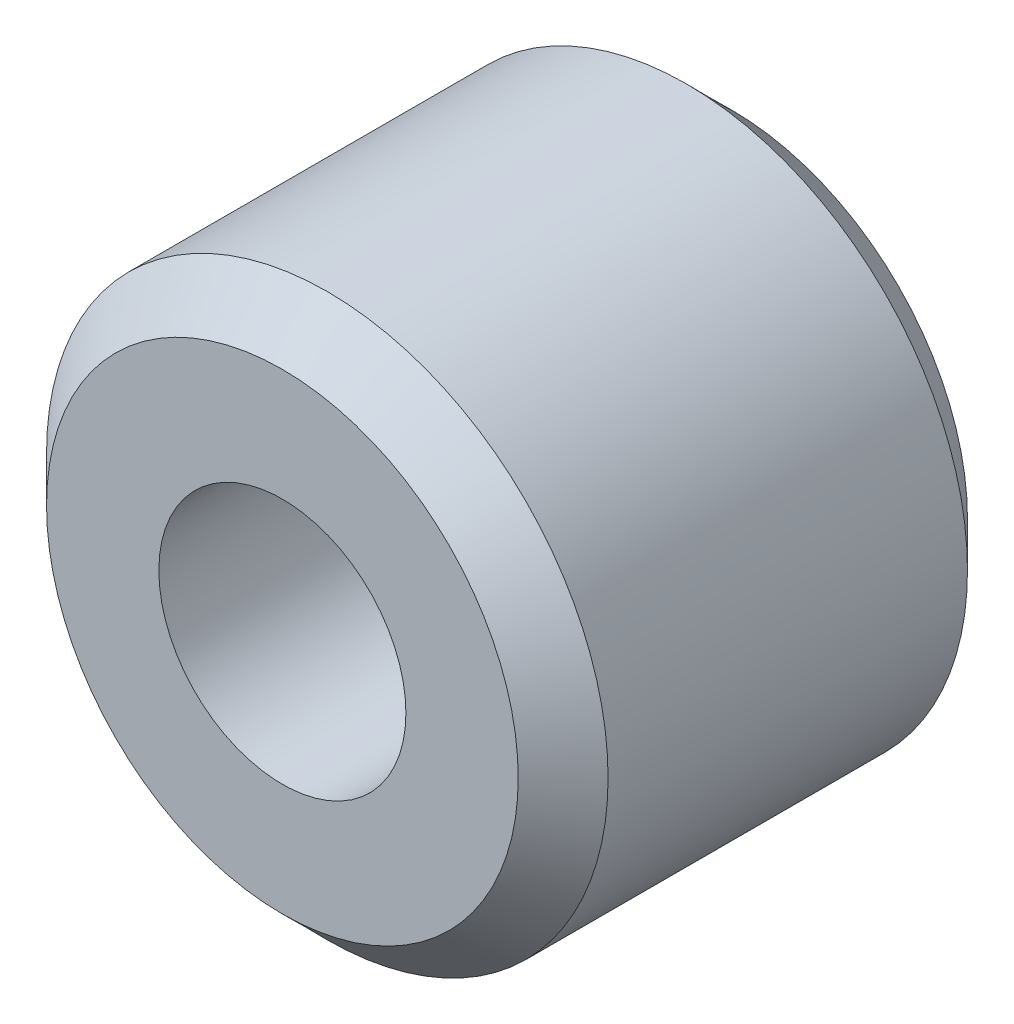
from build123d import *

# Parameters (mm, degrees)
ESQUISSE1_R             = 12.5
BOSS_EXTRU_1_DEPTH      = 20
CHANFREIN1_SIZE         = 2
ESQUISSE2_R             = 5.5
ENL_V_MAT_EXTRU_1_DEPTH = 20


with BuildPart() as part:
    # Esquisse1 → Boss.-Extru.1 (new body)
    with BuildSketch(Plane.XY):
        Circle(ESQUISSE1_R)
    extrude(amount=BOSS_EXTRU_1_DEPTH)

    # Chanfrein1
    chanfrein1_edges = [part.edges().sort_by_distance(p)[0] for p in [
        (-12.5, 0, 0),
        (-12.5, 0, 20),
    ]]
    chamfer(chanfrein1_edges, length=CHANFREIN1_SIZE)

    # Esquisse2 → Enl_v. mat.-Extru.1 (cut)
    with BuildSketch(Plane.XY.offset(20)):
        Circle(ESQUISSE2_R)
    extrude(amount=-ENL_V_MAT_EXTRU_1_DEPTH, mode=Mode.SUBTRACT)


solid = part.part
